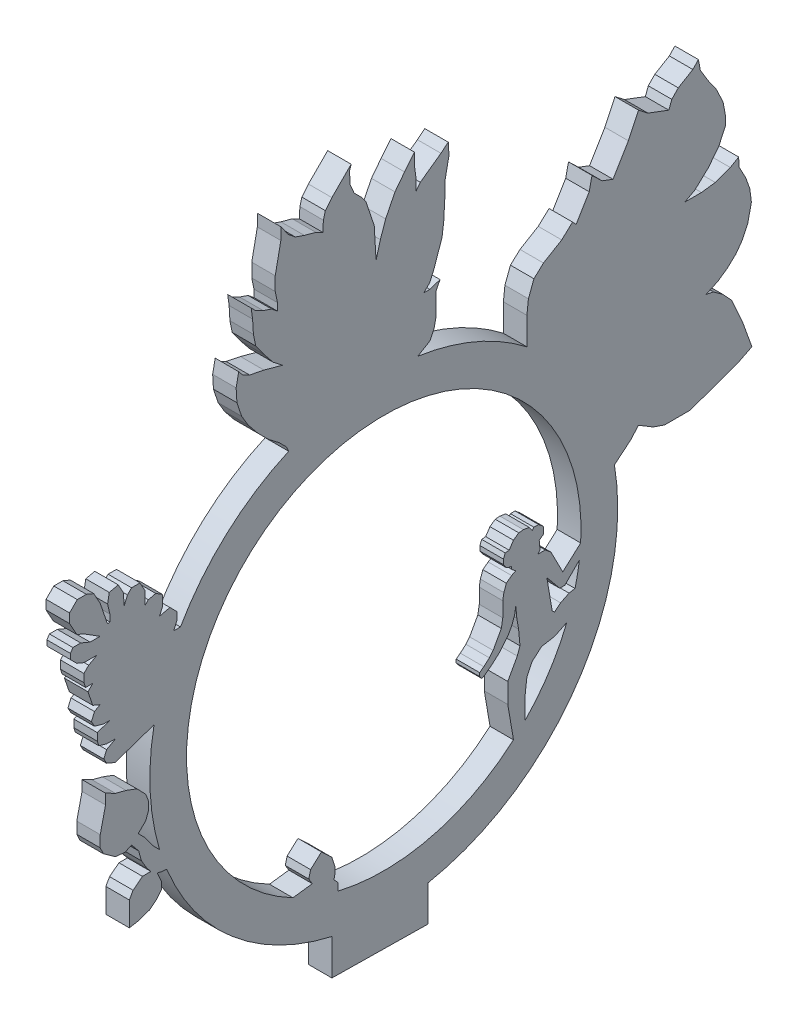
from build123d import *

# Parameters (mm, degrees)
RESSALTO_EXTRUS_O1_DEPTH = 6


with BuildPart() as part:
    # Esbo_o1 → Ressalto-extrus_o1 (new body)
    with BuildSketch(Plane(origin=(0, 0, 0), x_dir=(0, 0, -1), z_dir=(1, 0, 0))):
        with BuildLine():
            Line((226.030687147, 496.394302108), (227.479255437, 496.237565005))
            ThreePointArc((227.479255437, 496.237565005), (244.148095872, 473.071627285), (269.659836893, 460.278583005))
            Line((269.659836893, 460.278583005), (269.659836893, 451.100205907))
            Line((269.659836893, 451.100205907), (294.252569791, 450.748912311))
            Line((294.252569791, 450.748912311), (294.252569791, 459.875328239))
            ThreePointArc((294.252569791, 459.875328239), (332.030580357, 484.510175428), (341.830395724, 528.533094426))
            Line((341.830395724, 528.533094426), (343.423708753, 529.845965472))
            Line((343.423708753, 529.845965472), (346.005069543, 531.97297616))
            Line((346.005069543, 531.97297616), (347.967166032, 534.22150603))
            Line((347.967166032, 534.22150603), (349.046775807, 533.567768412))
            Line((349.046775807, 533.567768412), (351.680482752, 531.97297616))
            Line((351.680482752, 531.97297616), (354.64565463, 530.945877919))
            Line((354.64565463, 530.945877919), (358.13894118, 530.945877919))
            Line((358.13894118, 530.945877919), (361.205384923, 530.945877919))
            Line((361.205384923, 530.945877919), (364.058117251, 531.97297616))
            Line((364.058117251, 531.97297616), (368.487601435, 533.567768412))
            Line((368.487601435, 533.567768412), (373.456728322, 535.356853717))
            Line((373.456728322, 535.356853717), (376.9455288, 537.104711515))
            Line((376.9455288, 537.104711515), (375.876729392, 540.073267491))
            Line((375.876729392, 540.073267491), (374.511421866, 543.86536523))
            Line((374.511421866, 543.86536523), (373.456728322, 546.197826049))
            Line((373.456728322, 546.197826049), (371.740658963, 549.992923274))
            Line((371.740658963, 549.992923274), (369.441036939, 552.471025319))
            Line((369.441036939, 552.471025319), (367.150235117, 554.107110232))
            Line((367.150235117, 554.107110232), (365.205675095, 554.538609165))
            Line((365.205675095, 554.538609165), (368.251648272, 555.915939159))
            Line((368.251648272, 555.915939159), (370.630425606, 557.586588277))
            Line((370.630425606, 557.586588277), (372.850892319, 559.647130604))
            Line((372.850892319, 559.647130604), (374.511421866, 561.972159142))
            Line((374.511421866, 561.972159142), (375.876729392, 564.887462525))
            Line((375.876729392, 564.887462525), (376.816164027, 569.121046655))
            Line((376.816164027, 569.121046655), (376.400652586, 572.378330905))
            Line((376.400652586, 572.378330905), (375.352806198, 575.288690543))
            Line((375.352806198, 575.288690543), (373.670037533, 578.456511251))
            Line((373.670037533, 578.456511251), (373.557972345, 580.766851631))
            Line((373.557972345, 580.766851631), (371.43365942, 579.501068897))
            Line((371.43365942, 579.501068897), (367.591362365, 578.117687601))
            Line((367.591362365, 578.117687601), (364.058117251, 577.666973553))
            Line((364.058117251, 577.666973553), (359.817506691, 577.666973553))
            Line((359.817506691, 577.666973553), (362.303365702, 578.987479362))
            Line((362.303365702, 578.987479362), (365.812868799, 582.244217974))
            Line((365.812868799, 582.244217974), (368.487601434, 585.693562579))
            Line((368.487601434, 585.693562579), (370.142094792, 589.226356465))
            Line((370.142094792, 589.226356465), (370.142094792, 591.88580645))
            Line((370.142094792, 591.88580645), (369.594275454, 594.813668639))
            Line((369.594275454, 594.813668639), (367.960496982, 598.426779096))
            Line((367.960496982, 598.426779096), (365.609585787, 601.774157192))
            Line((365.609585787, 601.774157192), (363.763664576, 604.872093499))
            Line((363.763664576, 604.872093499), (363.280275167, 607.455605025))
            Line((363.280275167, 607.455605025), (361.852499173, 605.978464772))
            Line((361.852499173, 605.978464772), (358.13894118, 603.765722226))
            Line((358.13894118, 603.765722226), (356.48296579, 602.052492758))
            Line((356.48296579, 602.052492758), (355.724785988, 600.040742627))
            Line((355.724785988, 600.040742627), (353.749854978, 600.785046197))
            Line((353.749854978, 600.785046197), (350.38681922, 602.052492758))
            Line((350.38681922, 602.052492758), (347.967166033, 603.928769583))
            Line((347.967166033, 603.928769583), (345.390449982, 598.426779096))
            Line((345.390449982, 598.426779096), (342.71352047, 593.956211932))
            Line((342.71352047, 593.956211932), (341.47378302, 591.88580645))
            Line((341.47378302, 591.88580645), (340.730031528, 592.166108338))
            Line((340.730031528, 592.166108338), (338.662629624, 592.945261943))
            Line((338.662629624, 592.945261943), (336.097980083, 595.424203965))
            Line((336.097980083, 595.424203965), (335.375006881, 592.166108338))
            Line((335.375006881, 592.166108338), (333.758232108, 589.466037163))
            Line((333.758232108, 589.466037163), (332.043958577, 586.603139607))
            Line((332.043958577, 586.603139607), (331.130104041, 587.58792092))
            Line((331.130104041, 587.58792092), (328.361255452, 585.018492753))
            Line((328.361255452, 585.018492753), (323.705300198, 582.244217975))
            Line((323.705300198, 582.244217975), (321.265325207, 579.979976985))
            Line((321.265325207, 579.979976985), (319.86162186, 576.255398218))
            Line((319.86162186, 576.255398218), (319.464933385, 572.793068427))
            Line((319.464933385, 572.793068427), (319.464933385, 568.890723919))
            Line((319.464933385, 568.890723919), (319.464933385, 565.820329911))
            ThreePointArc((319.464933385, 565.820329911), (306.296402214, 573.537542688), (291.602410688, 577.666973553))
            Line((291.602410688, 577.666973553), (294.674425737, 579.501068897))
            Line((294.674425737, 579.501068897), (295.768972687, 581.698440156))
            Line((295.768972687, 581.698440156), (296.258390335, 584.121856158))
            Line((296.258390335, 584.121856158), (296.258390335, 586.901259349))
            Line((296.258390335, 586.901259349), (296.258390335, 589.7394102))
            Line((296.258390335, 589.7394102), (297.280141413, 591.790639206))
            Line((297.280141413, 591.790639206), (294.674425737, 590.917699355))
            Line((294.674425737, 590.917699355), (293.138418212, 590.917699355))
            Line((293.138418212, 590.917699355), (294.674425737, 592.45370688))
            Line((294.674425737, 592.45370688), (295.768972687, 594.997033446))
            Line((295.768972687, 594.997033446), (296.769265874, 597.90470741))
            Line((296.769265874, 597.90470741), (297.795743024, 600.888493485))
            Line((297.795743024, 600.888493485), (298.227959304, 604.214994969))
            Line((298.227959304, 604.214994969), (298.449077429, 608.231723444))
            Line((298.449077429, 608.231723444), (298.601425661, 610.99921019))
            Line((298.601425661, 610.99921019), (298.601425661, 613.31125411))
            Line((298.601425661, 613.31125411), (299.20760895, 616.312850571))
            Line((299.20760895, 616.312850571), (299.566441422, 618.089656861))
            Line((299.566441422, 618.089656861), (299.387025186, 621.131320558))
            Line((299.387025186, 621.131320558), (297.512051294, 619.610488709))
            Line((297.512051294, 619.610488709), (294.674425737, 617.567571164))
            Line((294.674425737, 617.567571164), (292.248047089, 615.820726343))
            Line((292.248047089, 615.820726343), (291.117651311, 614.351239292))
            Line((291.117651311, 614.351239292), (291.117651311, 617.567571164))
            Line((291.117651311, 617.567571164), (290.759169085, 620.124598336))
            Line((290.759169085, 620.124598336), (290.759169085, 623.239288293))
            Line((290.759169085, 623.239288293), (288.226546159, 620.124598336))
            Line((288.226546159, 620.124598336), (285.774340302, 616.936790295))
            Line((285.774340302, 616.936790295), (283.392567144, 612.15523215))
            Line((283.392567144, 612.15523215), (282.042808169, 608.231723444))
            Line((282.042808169, 608.231723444), (280.941158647, 604.214994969))
            Line((280.941158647, 604.214994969), (280.646419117, 609.211747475))
            Line((280.646419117, 609.211747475), (280.47279409, 612.15523215))
            Line((280.47279409, 612.15523215), (279.44638917, 615.219039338))
            Line((279.44638917, 615.219039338), (278.336952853, 618.530694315))
            Line((278.336952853, 618.530694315), (277.398438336, 619.834296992))
            Line((277.398438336, 619.834296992), (275.337644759, 621.895090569))
            Line((275.337644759, 621.895090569), (274.338864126, 624.243170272))
            Line((274.338864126, 624.243170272), (274.152563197, 627.401550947))
            Line((274.152563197, 627.401550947), (274.585449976, 628.659875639))
            Line((274.585449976, 628.659875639), (271.591364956, 625.66579062))
            Line((271.591364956, 625.66579062), (269.659836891, 623.734262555))
            Line((269.659836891, 623.734262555), (267.991050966, 621.681943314))
            Line((267.991050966, 621.681943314), (267.484305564, 619.834296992))
            Line((267.484305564, 619.834296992), (267.339358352, 617.201253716))
            Line((267.339358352, 617.201253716), (265.555833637, 618.089656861))
            Line((265.555833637, 618.089656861), (262.627974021, 618.892667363))
            Line((262.627974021, 618.892667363), (260.324873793, 619.684976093))
            Line((260.324873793, 619.684976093), (258.546119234, 621.131320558))
            Line((258.546119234, 621.131320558), (256.619460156, 623.807462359))
            Line((256.619460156, 623.807462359), (256.619460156, 620.758120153))
            Line((256.619460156, 620.758120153), (255.747745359, 616.441709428))
            Line((255.747745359, 616.441709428), (255.191449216, 613.687135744))
            Line((255.191449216, 613.687135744), (255.191449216, 610.193477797))
            Line((255.191449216, 610.193477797), (255.747745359, 607.455605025))
            Line((255.747745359, 607.455605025), (255.747745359, 605.575934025))
            Line((255.747745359, 605.575934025), (254.263741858, 606.782609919))
            Line((254.263741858, 606.782609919), (252.097703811, 607.527766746))
            Line((252.097703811, 607.527766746), (250.162953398, 608.491497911))
            Line((250.162953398, 608.491497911), (249.038984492, 609.615466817))
            Line((249.038984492, 609.615466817), (249.40881228, 606.977512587))
            Line((249.40881228, 606.977512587), (249.612720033, 603.520641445))
            Line((249.612720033, 603.520641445), (250.198033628, 600.639956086))
            Line((250.198033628, 600.639956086), (252.307705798, 597.709607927))
            Line((252.307705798, 597.709607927), (254.656664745, 594.813668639))
            Line((254.656664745, 594.813668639), (257.085548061, 592.945261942))
            Line((257.085548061, 592.945261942), (252.307705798, 594.255658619))
            Line((252.307705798, 594.255658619), (248.636690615, 594.997033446))
            Line((248.636690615, 594.997033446), (246.870530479, 595.876787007))
            Line((246.870530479, 595.876787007), (245.856972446, 597.126362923))
            Line((245.856972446, 597.126362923), (245.201249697, 593.87946529))
            Line((245.201249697, 593.87946529), (245.401179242, 590.490037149))
            Line((245.401179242, 590.490037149), (246.603454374, 586.901259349))
            Line((246.603454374, 586.901259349), (248.26285069, 584.121856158))
            Line((248.26285069, 584.121856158), (250.706676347, 581.108959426))
            Line((250.706676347, 581.108959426), (253.482185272, 578.333450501))
            Line((253.482185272, 578.333450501), (256.183602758, 576.255398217))
            Line((256.183602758, 576.255398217), (258.070561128, 574.368439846))
            Line((258.070561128, 574.368439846), (258.617690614, 573.139100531))
            ThreePointArc((258.617690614, 573.139100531), (242.793027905, 562.829153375), (230.976481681, 548.095376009))
            Line((230.976481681, 548.095376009), (229.270970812, 548.095376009))
            Line((229.270970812, 548.095376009), (230.123726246, 550.128159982))
            Line((230.123726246, 550.128159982), (230.123726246, 551.914935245))
            Line((230.123726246, 551.914935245), (228.279326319, 553.759335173))
            Line((228.279326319, 553.759335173), (225.644911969, 553.14684667))
            Line((225.644911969, 553.14684667), (226.38722204, 554.916352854))
            Line((226.38722204, 554.916352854), (226.38722204, 557.586588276))
            Line((226.38722204, 557.586588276), (224.673044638, 558.661202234))
            Line((224.673044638, 558.661202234), (222.772331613, 558.219295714))
            Line((222.772331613, 558.219295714), (221.974765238, 557.42172934))
            Line((221.974765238, 557.42172934), (221.974765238, 560.604621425))
            Line((221.974765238, 560.604621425), (220.64402959, 563.006045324))
            Line((220.64402959, 563.006045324), (218.492720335, 563.006045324))
            Line((218.492720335, 563.006045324), (217.441584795, 561.954909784))
            Line((217.441584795, 561.954909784), (216.600659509, 559.950326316))
            Line((216.600659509, 559.950326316), (216.390449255, 563.006045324))
            Line((216.390449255, 563.006045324), (215.084015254, 565.363614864))
            Line((215.084015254, 565.363614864), (212.798303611, 564.832198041))
            Line((212.798303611, 564.832198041), (212.364907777, 562.480477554))
            Line((212.364907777, 562.480477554), (212.953155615, 559.950326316))
            Line((212.953155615, 559.950326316), (212.953155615, 558.219295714))
            Line((212.953155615, 558.219295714), (212.349115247, 558.078859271))
            Line((212.349115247, 558.078859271), (211.278705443, 561.215401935))
            Line((211.278705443, 561.215401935), (210.445685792, 563.656337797))
            Line((210.445685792, 563.656337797), (208.851299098, 566.533542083))
            Line((208.851299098, 566.533542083), (206.949266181, 567.331447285))
            Line((206.949266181, 567.331447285), (204.625085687, 567.331447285))
            Line((204.625085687, 567.331447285), (202.657253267, 565.363614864))
            Line((202.657253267, 565.363614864), (202.657253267, 563.006045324))
            Line((202.657253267, 563.006045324), (203.503908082, 561.47818582))
            Line((203.503908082, 561.47818582), (204.518577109, 559.647130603))
            Line((204.518577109, 559.647130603), (206.243080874, 558.923699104))
            Line((206.243080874, 558.923699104), (208.851299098, 557.288612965))
            Line((208.851299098, 557.288612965), (210.445685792, 556.289095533))
            Line((210.445685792, 556.289095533), (207.900282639, 556.289095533))
            Line((207.900282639, 556.289095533), (205.517649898, 557.288612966))
            Line((205.517649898, 557.288612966), (203.503908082, 557.288612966))
            Line((203.503908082, 557.288612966), (202.877312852, 556.289095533))
            Line((202.877312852, 556.289095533), (202.877312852, 554.916352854))
            Line((202.877312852, 554.916352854), (204.51077899, 553.282886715))
            Line((204.51077899, 553.282886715), (206.320667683, 552.523636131))
            Line((206.320667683, 552.523636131), (208.387667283, 552.523636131))
            Line((208.387667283, 552.523636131), (209.648492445, 552.523636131))
            Line((209.648492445, 552.523636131), (207.538910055, 551.354622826))
            Line((207.538910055, 551.354622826), (206.320667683, 550.136380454))
            Line((206.320667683, 550.136380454), (206.320667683, 548.095376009))
            Line((206.320667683, 548.095376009), (206.758100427, 546.813599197))
            Line((206.758100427, 546.813599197), (208.59370125, 546.813599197))
            Line((208.59370125, 546.813599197), (207.354167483, 545.57406543))
            Line((207.354167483, 545.57406543), (207.90028264, 543.973824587))
            Line((207.90028264, 543.973824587), (208.59370125, 541.941951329))
            Line((208.59370125, 541.941951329), (210.445685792, 541.165041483))
            Line((210.445685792, 541.165041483), (209.018079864, 540.373941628))
            Line((209.018079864, 540.373941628), (208.237529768, 538.513279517))
            Line((208.237529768, 538.513279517), (209.018079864, 537.104711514))
            Line((209.018079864, 537.104711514), (211.278705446, 536.456179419))
            Line((211.278705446, 536.456179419), (212.953155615, 536.456179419))
            Line((212.953155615, 536.456179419), (209.731882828, 535.356853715))
            Line((209.731882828, 535.356853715), (209.731882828, 533.440618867))
            Line((209.731882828, 533.440618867), (210.148392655, 532.220150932))
            Line((210.148392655, 532.220150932), (212.115930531, 531.655700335))
            Line((212.115930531, 531.655700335), (214.393975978, 531.655700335))
            Line((214.393975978, 531.655700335), (212.115930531, 530.393334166))
            Line((212.115930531, 530.393334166), (211.394082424, 528.672604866))
            Line((211.394082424, 528.672604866), (212.115930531, 527.369969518))
            Line((212.115930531, 527.369969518), (214.298735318, 526.454280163))
            Line((214.298735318, 526.454280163), (215.640323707, 526.91212484))
            Line((215.640323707, 526.91212484), (218.272810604, 527.810515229))
            Line((218.272810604, 527.810515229), (220.644029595, 528.619742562))
            Line((220.644029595, 528.619742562), (224.237139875, 529.845965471))
            ThreePointArc((224.237139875, 529.845965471), (223.23247231, 515.582912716), (225.644911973, 501.489504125))
            Line((225.644911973, 501.489504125), (224.069537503, 503.101563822))
            Line((224.069537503, 503.101563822), (221.974765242, 505.953541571))
            Line((221.974765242, 505.953541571), (220.193243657, 507.776548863))
            Line((220.193243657, 507.776548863), (220.644029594, 508.217076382))
            Line((220.644029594, 508.217076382), (222.091366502, 509.631476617))
            Line((222.091366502, 509.631476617), (222.772331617, 511.455175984))
            Line((222.772331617, 511.455175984), (222.772331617, 513.810653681))
            Line((222.772331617, 513.810653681), (222.091366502, 515.560545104))
            Line((222.091366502, 515.560545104), (219.855730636, 517.848241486))
            Line((219.855730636, 517.848241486), (217.072087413, 518.88764741))
            Line((217.072087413, 518.88764741), (214.393975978, 519.587306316))
            Line((214.393975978, 519.587306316), (211.842497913, 520.894736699))
            Line((211.842497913, 520.894736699), (211.842497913, 518.279875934))
            Line((211.842497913, 518.279875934), (211.278705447, 515.827110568))
            Line((211.278705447, 515.827110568), (210.491480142, 512.402306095))
            Line((210.491480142, 512.402306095), (210.491480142, 509.471777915))
            Line((210.491480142, 509.471777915), (211.278705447, 507.776548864))
            Line((211.278705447, 507.776548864), (214.393975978, 505.555426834))
            Line((214.393975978, 505.555426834), (216.845694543, 505.350085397))
            Line((216.845694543, 505.350085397), (218.492720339, 506.114926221))
            Line((218.492720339, 506.114926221), (220.303731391, 503.890628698))
            Line((220.303731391, 503.890628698), (221.018143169, 501.33784308))
            Line((221.018143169, 501.33784308), (222.351647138, 499.098373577))
            Line((222.351647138, 499.098373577), (223.415024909, 497.792324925))
            Line((223.415024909, 497.792324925), (222.351647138, 497.792324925))
            Line((222.351647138, 497.792324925), (221.263957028, 497.792324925))
            Line((221.263957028, 497.792324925), (220.303731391, 497.031028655))
            Line((220.303731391, 497.031028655), (218.879853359, 495.902134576))
            Line((218.879853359, 495.902134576), (217.916056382, 494.233465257))
            Line((217.916056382, 494.233465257), (217.916056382, 492.421522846))
            Line((217.916056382, 492.421522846), (217.916056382, 490.067520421))
            Line((217.916056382, 490.067520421), (217.916056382, 488.059423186))
            Line((217.916056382, 488.059423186), (220.151542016, 488.440413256))
            Line((220.151542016, 488.440413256), (223.094532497, 489.441774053))
            Line((223.094532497, 489.441774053), (224.673044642, 490.693266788))
            Line((224.673044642, 490.693266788), (226.13934547, 492.421522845))
            Line((226.13934547, 492.421522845), (226.13934547, 494.233465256))
            Line((226.13934547, 494.233465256), (225.524381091, 495.566498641))
            Line((225.524381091, 495.566498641), (225.018075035, 496.663997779))
            Line((225.018075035, 496.663997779), (226.030687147, 496.394302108))
        make_face()
        with BuildLine():
            Line((264.664980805, 474.460451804), (259.708361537, 473.824622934))
            ThreePointArc((259.708361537, 473.824622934), (258.036784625, 562.359277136), (333.210302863, 515.560545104))
            Line((333.210302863, 515.560545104), (328.629306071, 511.455175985))
            Line((328.629306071, 511.455175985), (326.834129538, 514.946312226))
            Line((326.834129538, 514.946312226), (325.604561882, 517.337491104))
            Line((325.604561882, 517.337491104), (324.151764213, 518.545881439))
            Line((324.151764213, 518.545881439), (322.253310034, 518.545881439))
            Line((322.253310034, 518.545881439), (322.825515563, 519.233820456))
            Line((322.825515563, 519.233820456), (322.621211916, 521.458346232))
            Line((322.621211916, 521.458346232), (323.705300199, 522.225015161))
            Line((323.705300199, 522.225015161), (323.705300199, 523.977483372))
            Line((323.705300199, 523.977483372), (322.455629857, 525.016918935))
            Line((322.455629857, 525.016918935), (321.265325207, 525.016918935))
            Line((321.265325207, 525.016918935), (320.833040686, 524.497201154))
            Line((320.833040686, 524.497201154), (320.077979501, 525.564875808))
            Line((320.077979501, 525.564875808), (318.569502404, 525.823591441))
            Line((318.569502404, 525.823591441), (317.388698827, 525.715144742))
            Line((317.388698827, 525.715144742), (316.03394405, 524.757060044))
            Line((316.03394405, 524.757060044), (315.108283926, 523.359995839))
            Line((315.108283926, 523.359995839), (314.936844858, 523.101249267))
            Line((314.936844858, 523.101249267), (313.910976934, 523.007032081))
            Line((313.910976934, 523.007032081), (313.490501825, 521.841680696))
            Line((313.490501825, 521.841680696), (313.490501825, 520.619768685))
            Line((313.490501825, 520.619768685), (314.220660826, 519.587306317))
            Line((314.220660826, 519.587306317), (315.200350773, 519.233820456))
            Line((315.200350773, 519.233820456), (315.571113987, 519.233820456))
            Line((315.571113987, 519.233820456), (315.571113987, 518.54588144))
            Line((315.571113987, 518.54588144), (316.297512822, 517.941686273))
            Line((316.297512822, 517.941686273), (316.587520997, 517.700466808))
            Line((316.587520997, 517.700466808), (315.571113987, 517.177820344))
            Line((315.571113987, 517.177820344), (314.220660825, 516.141901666))
            Line((314.220660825, 516.141901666), (313.588467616, 514.38977124))
            Line((313.588467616, 514.38977124), (313.306639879, 512.746535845))
            Line((313.306639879, 512.746535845), (313.306639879, 508.931034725))
            Line((313.306639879, 508.931034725), (312.938892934, 506.786835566))
            Line((312.938892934, 506.786835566), (311.736574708, 504.595050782))
            Line((311.736574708, 504.595050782), (310.846682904, 502.972808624))
            Line((310.846682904, 502.972808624), (309.88507657, 501.816709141))
            Line((309.88507657, 501.816709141), (308.462358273, 500.559400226))
            Line((308.462358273, 500.559400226), (307.423646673, 499.762615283))
            Line((307.423646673, 499.762615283), (307.423646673, 498.889477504))
            Line((307.423646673, 498.889477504), (307.943002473, 498.212430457))
            Line((307.943002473, 498.212430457), (308.772900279, 498.639172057))
            Line((308.772900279, 498.639172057), (310.515531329, 499.975926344))
            Line((310.515531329, 499.975926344), (312.337733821, 501.586274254))
            Line((312.337733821, 501.586274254), (313.447553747, 502.920564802))
            Line((313.447553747, 502.920564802), (314.710505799, 504.438959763))
            Line((314.710505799, 504.438959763), (315.620424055, 506.097709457))
            Line((315.620424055, 506.097709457), (316.320322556, 508.03748584))
            Line((316.320322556, 508.03748584), (316.638183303, 509.890816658))
            Line((316.638183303, 509.890816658), (316.897471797, 507.067597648))
            Line((316.897471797, 507.067597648), (317.344224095, 504.438959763))
            Line((317.344224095, 504.438959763), (317.700528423, 500.559400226))
            Line((317.700528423, 500.559400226), (317.007683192, 498.639172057))
            Line((317.007683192, 498.639172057), (315.506262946, 495.902134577))
            Line((315.506262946, 495.902134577), (314.590903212, 494.233465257))
            Line((314.590903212, 494.233465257), (314.590903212, 489.147002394))
            Line((314.590903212, 489.147002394), (315.048583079, 486.454067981))
            Line((315.048583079, 486.454067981), (315.659628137, 482.858750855))
            Line((315.659628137, 482.858750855), (316.045745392, 480.58688242))
            ThreePointArc((316.045745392, 480.58688242), (294.994936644, 469.631571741), (271.264269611, 469.527537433))
            Line((271.264269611, 469.527537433), (271.264269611, 471.383505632))
            Line((271.264269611, 471.383505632), (270.176204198, 472.58931503))
            Line((270.176204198, 472.58931503), (270.475202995, 473.824622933))
            Line((270.475202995, 473.824622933), (270.475202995, 475.199093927))
            Line((270.475202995, 475.199093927), (269.659836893, 477.800024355))
            Line((269.659836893, 477.800024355), (267.001899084, 480.31548952))
            Line((267.001899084, 480.31548952), (264.214225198, 477.800024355))
            Line((264.214225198, 477.800024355), (263.763469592, 475.937736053))
            Line((263.763469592, 475.937736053), (264.664980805, 474.460451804))
        make_face(mode=Mode.SUBTRACT)
        with BuildLine():
            Line((327.856081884, 508.217076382), (329.143414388, 508.217076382))
            Line((329.143414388, 508.217076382), (332.863522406, 511.937184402))
            ThreePointArc((332.863522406, 511.937184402), (332.397684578, 509.059377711), (331.76618324, 506.213330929))
            Line((331.76618324, 506.213330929), (330.237613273, 505.953541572))
            Line((330.237613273, 505.953541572), (328.08025473, 504.881151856))
            Line((328.08025473, 504.881151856), (326.521241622, 503.598461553))
            Line((326.521241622, 503.598461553), (325.930416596, 504.189286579))
            Line((325.930416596, 504.189286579), (324.566306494, 512.215549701))
            Line((324.566306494, 512.215549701), (327.856081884, 508.217076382))
        make_face(mode=Mode.SUBTRACT)
        with BuildLine():
            Line((329.66667467, 499.762615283), (326.52124162, 498.212430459))
            Line((326.52124162, 498.212430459), (323.231308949, 497.653287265))
            Line((323.231308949, 497.653287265), (320.833040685, 495.566498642))
            Line((320.833040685, 495.566498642), (319.464933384, 492.766521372))
            Line((319.464933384, 492.766521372), (318.983295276, 488.698794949))
            Line((318.983295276, 488.698794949), (318.983295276, 483.366205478))
            ThreePointArc((318.983295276, 483.366205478), (325.128710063, 491.040728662), (329.66667467, 499.762615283))
        make_face(mode=Mode.SUBTRACT)
    extrude(amount=RESSALTO_EXTRUS_O1_DEPTH)


solid = part.part
